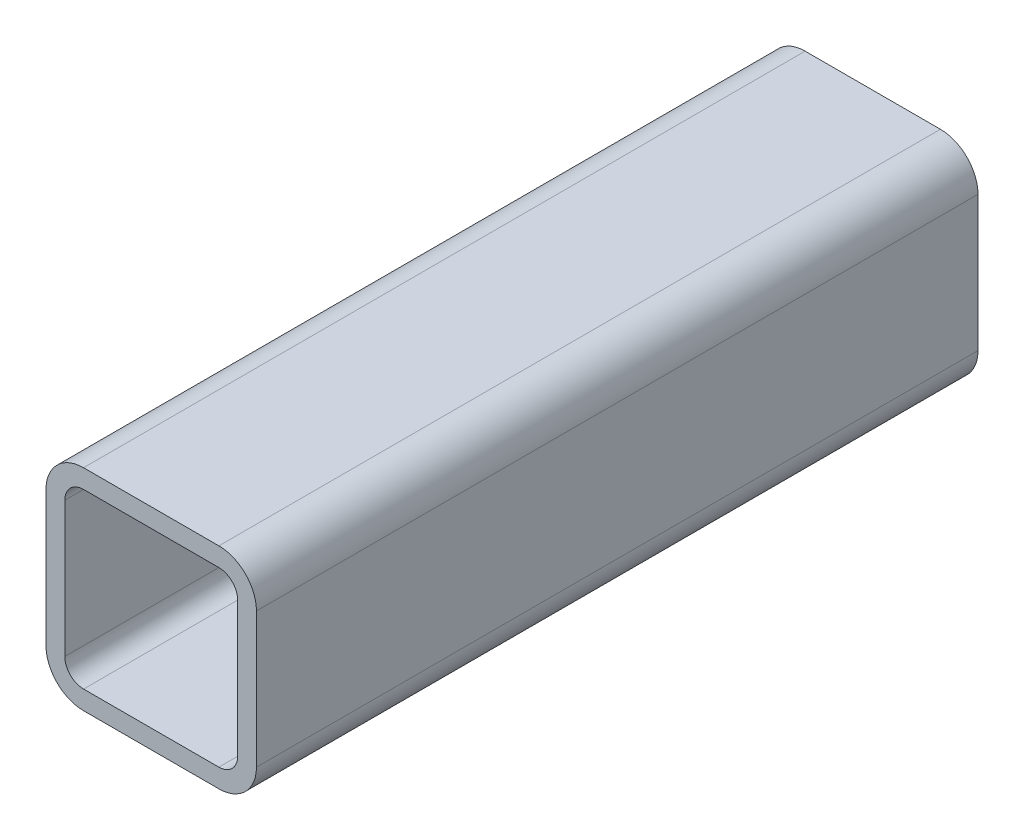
ISO-10303-21;
HEADER;
FILE_DESCRIPTION(('STEP AP214'),'2;1');
FILE_NAME('part.step','',(''),(''),'','','');
FILE_SCHEMA(('AUTOMOTIVE_DESIGN { 1 0 10303 214 1 1 1 1 }'));
ENDSEC;
DATA;
#1=APPLICATION_CONTEXT('core data for automotive mechanical design processes');
#2=APPLICATION_PROTOCOL_DEFINITION('international standard','automotive_design',2000,#1);
#3=PRODUCT_CONTEXT('',#1,'mechanical');
#4=PRODUCT('Part','Part','',(#3));
#5=PRODUCT_RELATED_PRODUCT_CATEGORY('part','',(#4));
#6=PRODUCT_DEFINITION_FORMATION('','',#4);
#7=PRODUCT_DEFINITION_CONTEXT('part definition',#1,'design');
#8=PRODUCT_DEFINITION('design','',#6,#7);
#9=PRODUCT_DEFINITION_SHAPE('','',#8);
#10=(LENGTH_UNIT() NAMED_UNIT(*) SI_UNIT(.MILLI.,.METRE.));
#11=(NAMED_UNIT(*) PLANE_ANGLE_UNIT() SI_UNIT($,.RADIAN.));
#12=(NAMED_UNIT(*) SI_UNIT($,.STERADIAN.) SOLID_ANGLE_UNIT());
#13=UNCERTAINTY_MEASURE_WITH_UNIT(LENGTH_MEASURE(1.E-05),#10,'distance_accuracy_value','');
#14=(GEOMETRIC_REPRESENTATION_CONTEXT(3) GLOBAL_UNCERTAINTY_ASSIGNED_CONTEXT((#13)) GLOBAL_UNIT_ASSIGNED_CONTEXT((#10,
#11,#12)) REPRESENTATION_CONTEXT('',''));
#15=CARTESIAN_POINT('',(0.,0.,0.));
#16=DIRECTION('',(0.,0.,1.));
#17=DIRECTION('',(1.,0.,0.));
#18=AXIS2_PLACEMENT_3D('',#15,#16,#17);
#19=CARTESIAN_POINT('',(17.9571469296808,73.8265103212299,304.8));
#20=DIRECTION('',(0.,0.,1.));
#21=DIRECTION('',(1.,0.,0.));
#22=AXIS2_PLACEMENT_3D('',#19,#20,#21);
#23=PLANE('',#22);
#24=CARTESIAN_POINT('',(17.9571469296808,73.8265103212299,304.8));
#25=DIRECTION('',(0.,0.,1.));
#26=DIRECTION('',(1.,0.,0.));
#27=AXIS2_PLACEMENT_3D('',#24,#25,#26);
#28=CIRCLE('',#27,15.875);
#29=CARTESIAN_POINT('',(17.9571469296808,89.7015103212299,304.8));
#30=VERTEX_POINT('',#29);
#31=CARTESIAN_POINT('',(2.08214692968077,73.8265103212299,304.8));
#32=VERTEX_POINT('',#31);
#33=EDGE_CURVE('E211',#30,#32,#28,.T.);
#34=ORIENTED_EDGE('',*,*,#33,.T.);
#35=DIRECTION('',(0.,-1.,0.));
#36=VECTOR('',#35,1.);
#37=CARTESIAN_POINT('',(2.08214692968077,16.6765103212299,304.8));
#38=LINE('',#37,#36);
#39=CARTESIAN_POINT('',(2.08214692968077,16.6765103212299,304.8));
#40=VERTEX_POINT('',#39);
#41=EDGE_CURVE('E214',#32,#40,#38,.T.);
#42=ORIENTED_EDGE('',*,*,#41,.T.);
#43=CARTESIAN_POINT('',(17.9571469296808,16.6765103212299,304.8));
#44=DIRECTION('',(0.,0.,1.));
#45=DIRECTION('',(1.,0.,0.));
#46=AXIS2_PLACEMENT_3D('',#43,#44,#45);
#47=CIRCLE('',#46,15.875);
#48=CARTESIAN_POINT('',(17.9571469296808,0.801510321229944,304.8));
#49=VERTEX_POINT('',#48);
#50=EDGE_CURVE('E217',#40,#49,#47,.T.);
#51=ORIENTED_EDGE('',*,*,#50,.T.);
#52=DIRECTION('',(1.,0.,0.));
#53=VECTOR('',#52,1.);
#54=CARTESIAN_POINT('',(75.1071469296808,0.801510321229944,304.8));
#55=LINE('',#54,#53);
#56=CARTESIAN_POINT('',(75.1071469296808,0.801510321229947,304.8));
#57=VERTEX_POINT('',#56);
#58=EDGE_CURVE('E219',#49,#57,#55,.T.);
#59=ORIENTED_EDGE('',*,*,#58,.T.);
#60=CARTESIAN_POINT('',(75.1071469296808,16.6765103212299,304.8));
#61=DIRECTION('',(0.,0.,1.));
#62=DIRECTION('',(1.,0.,0.));
#63=AXIS2_PLACEMENT_3D('',#60,#61,#62);
#64=CIRCLE('',#63,15.875);
#65=CARTESIAN_POINT('',(90.9821469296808,16.6765103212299,304.8));
#66=VERTEX_POINT('',#65);
#67=EDGE_CURVE('E221',#57,#66,#64,.T.);
#68=ORIENTED_EDGE('',*,*,#67,.T.);
#69=DIRECTION('',(0.,1.,0.));
#70=VECTOR('',#69,1.);
#71=CARTESIAN_POINT('',(90.9821469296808,73.8265103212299,304.8));
#72=LINE('',#71,#70);
#73=CARTESIAN_POINT('',(90.9821469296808,73.8265103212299,304.8));
#74=VERTEX_POINT('',#73);
#75=EDGE_CURVE('E223',#66,#74,#72,.T.);
#76=ORIENTED_EDGE('',*,*,#75,.T.);
#77=CARTESIAN_POINT('',(75.1071469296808,73.8265103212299,304.8));
#78=DIRECTION('',(0.,0.,1.));
#79=DIRECTION('',(1.,0.,0.));
#80=AXIS2_PLACEMENT_3D('',#77,#78,#79);
#81=CIRCLE('',#80,15.875);
#82=CARTESIAN_POINT('',(75.1071469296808,89.7015103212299,304.8));
#83=VERTEX_POINT('',#82);
#84=EDGE_CURVE('E225',#74,#83,#81,.T.);
#85=ORIENTED_EDGE('',*,*,#84,.T.);
#86=DIRECTION('',(-1.,0.,0.));
#87=VECTOR('',#86,1.);
#88=CARTESIAN_POINT('',(17.9571469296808,89.7015103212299,304.8));
#89=LINE('',#88,#87);
#90=EDGE_CURVE('E227',#83,#30,#89,.T.);
#91=ORIENTED_EDGE('',*,*,#90,.T.);
#92=EDGE_LOOP('',(#34,#42,#51,#59,#68,#76,#85,#91));
#93=FACE_BOUND('',#92,.T.);
#94=DIRECTION('',(0.,-1.,0.));
#95=VECTOR('',#94,1.);
#96=CARTESIAN_POINT('',(10.0196469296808,16.6765103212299,304.8));
#97=LINE('',#96,#95);
#98=CARTESIAN_POINT('',(10.0196469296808,73.8265103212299,304.8));
#99=VERTEX_POINT('',#98);
#100=CARTESIAN_POINT('',(10.0196469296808,16.6765103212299,304.8));
#101=VERTEX_POINT('',#100);
#102=EDGE_CURVE('E154',#99,#101,#97,.T.);
#103=ORIENTED_EDGE('',*,*,#102,.F.);
#104=CARTESIAN_POINT('',(17.9571469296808,73.8265103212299,304.8));
#105=DIRECTION('',(0.,0.,1.));
#106=DIRECTION('',(1.,0.,0.));
#107=AXIS2_PLACEMENT_3D('',#104,#105,#106);
#108=CIRCLE('',#107,7.9375);
#109=CARTESIAN_POINT('',(17.9571469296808,81.7640103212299,304.8));
#110=VERTEX_POINT('',#109);
#111=EDGE_CURVE('E146',#110,#99,#108,.T.);
#112=ORIENTED_EDGE('',*,*,#111,.F.);
#113=DIRECTION('',(-1.,0.,0.));
#114=VECTOR('',#113,1.);
#115=CARTESIAN_POINT('',(17.9571469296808,81.7640103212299,304.8));
#116=LINE('',#115,#114);
#117=CARTESIAN_POINT('',(75.1071469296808,81.7640103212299,304.8));
#118=VERTEX_POINT('',#117);
#119=EDGE_CURVE('E179',#118,#110,#116,.T.);
#120=ORIENTED_EDGE('',*,*,#119,.F.);
#121=CARTESIAN_POINT('',(75.1071469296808,73.8265103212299,304.8));
#122=DIRECTION('',(0.,0.,1.));
#123=DIRECTION('',(1.,0.,0.));
#124=AXIS2_PLACEMENT_3D('',#121,#122,#123);
#125=CIRCLE('',#124,7.93749999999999);
#126=CARTESIAN_POINT('',(83.0446469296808,73.8265103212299,304.8));
#127=VERTEX_POINT('',#126);
#128=EDGE_CURVE('E177',#127,#118,#125,.T.);
#129=ORIENTED_EDGE('',*,*,#128,.F.);
#130=DIRECTION('',(0.,1.,0.));
#131=VECTOR('',#130,1.);
#132=CARTESIAN_POINT('',(83.0446469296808,73.8265103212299,304.8));
#133=LINE('',#132,#131);
#134=CARTESIAN_POINT('',(83.0446469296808,16.6765103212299,304.8));
#135=VERTEX_POINT('',#134);
#136=EDGE_CURVE('E175',#135,#127,#133,.T.);
#137=ORIENTED_EDGE('',*,*,#136,.F.);
#138=CARTESIAN_POINT('',(75.1071469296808,16.6765103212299,304.8));
#139=DIRECTION('',(0.,0.,1.));
#140=DIRECTION('',(1.,0.,0.));
#141=AXIS2_PLACEMENT_3D('',#138,#139,#140);
#142=CIRCLE('',#141,7.9375);
#143=CARTESIAN_POINT('',(75.1071469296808,8.73901032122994,304.8));
#144=VERTEX_POINT('',#143);
#145=EDGE_CURVE('E173',#144,#135,#142,.T.);
#146=ORIENTED_EDGE('',*,*,#145,.F.);
#147=DIRECTION('',(1.,0.,0.));
#148=VECTOR('',#147,1.);
#149=CARTESIAN_POINT('',(75.1071469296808,8.73901032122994,304.8));
#150=LINE('',#149,#148);
#151=CARTESIAN_POINT('',(17.9571469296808,8.73901032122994,304.8));
#152=VERTEX_POINT('',#151);
#153=EDGE_CURVE('E169',#152,#144,#150,.T.);
#154=ORIENTED_EDGE('',*,*,#153,.F.);
#155=CARTESIAN_POINT('',(17.9571469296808,16.6765103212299,304.8));
#156=DIRECTION('',(0.,0.,1.));
#157=DIRECTION('',(1.,0.,0.));
#158=AXIS2_PLACEMENT_3D('',#155,#156,#157);
#159=CIRCLE('',#158,7.9375);
#160=EDGE_CURVE('E167',#101,#152,#159,.T.);
#161=ORIENTED_EDGE('',*,*,#160,.F.);
#162=EDGE_LOOP('',(#103,#112,#120,#129,#137,#146,#154,#161));
#163=FACE_BOUND('',#162,.T.);
#164=ADVANCED_FACE('F33',(#93,#163),#23,.T.);
#165=CARTESIAN_POINT('',(17.9571469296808,73.8265103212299,0.));
#166=DIRECTION('',(0.,0.,1.));
#167=DIRECTION('',(1.,0.,0.));
#168=AXIS2_PLACEMENT_3D('',#165,#166,#167);
#169=PLANE('',#168);
#170=CARTESIAN_POINT('',(17.9571469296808,73.8265103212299,0.));
#171=DIRECTION('',(0.,0.,1.));
#172=DIRECTION('',(1.,0.,0.));
#173=AXIS2_PLACEMENT_3D('',#170,#171,#172);
#174=CIRCLE('',#173,15.875);
#175=CARTESIAN_POINT('',(17.9571469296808,89.7015103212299,0.));
#176=VERTEX_POINT('',#175);
#177=CARTESIAN_POINT('',(2.08214692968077,73.8265103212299,0.));
#178=VERTEX_POINT('',#177);
#179=EDGE_CURVE('E162',#176,#178,#174,.T.);
#180=ORIENTED_EDGE('',*,*,#179,.F.);
#181=DIRECTION('',(-1.,0.,0.));
#182=VECTOR('',#181,1.);
#183=CARTESIAN_POINT('',(17.9571469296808,89.7015103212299,0.));
#184=LINE('',#183,#182);
#185=CARTESIAN_POINT('',(75.1071469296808,89.7015103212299,0.));
#186=VERTEX_POINT('',#185);
#187=EDGE_CURVE('E215',#186,#176,#184,.T.);
#188=ORIENTED_EDGE('',*,*,#187,.F.);
#189=CARTESIAN_POINT('',(75.1071469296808,73.8265103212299,0.));
#190=DIRECTION('',(0.,0.,1.));
#191=DIRECTION('',(1.,0.,0.));
#192=AXIS2_PLACEMENT_3D('',#189,#190,#191);
#193=CIRCLE('',#192,15.875);
#194=CARTESIAN_POINT('',(90.9821469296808,73.8265103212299,0.));
#195=VERTEX_POINT('',#194);
#196=EDGE_CURVE('E242',#195,#186,#193,.T.);
#197=ORIENTED_EDGE('',*,*,#196,.F.);
#198=DIRECTION('',(0.,1.,0.));
#199=VECTOR('',#198,1.);
#200=CARTESIAN_POINT('',(90.9821469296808,73.8265103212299,0.));
#201=LINE('',#200,#199);
#202=CARTESIAN_POINT('',(90.9821469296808,16.6765103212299,0.));
#203=VERTEX_POINT('',#202);
#204=EDGE_CURVE('E240',#203,#195,#201,.T.);
#205=ORIENTED_EDGE('',*,*,#204,.F.);
#206=CARTESIAN_POINT('',(75.1071469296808,16.6765103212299,0.));
#207=DIRECTION('',(0.,0.,1.));
#208=DIRECTION('',(1.,0.,0.));
#209=AXIS2_PLACEMENT_3D('',#206,#207,#208);
#210=CIRCLE('',#209,15.875);
#211=CARTESIAN_POINT('',(75.1071469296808,0.801510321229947,0.));
#212=VERTEX_POINT('',#211);
#213=EDGE_CURVE('E238',#212,#203,#210,.T.);
#214=ORIENTED_EDGE('',*,*,#213,.F.);
#215=DIRECTION('',(1.,0.,0.));
#216=VECTOR('',#215,1.);
#217=CARTESIAN_POINT('',(75.1071469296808,0.801510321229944,0.));
#218=LINE('',#217,#216);
#219=CARTESIAN_POINT('',(17.9571469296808,0.801510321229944,0.));
#220=VERTEX_POINT('',#219);
#221=EDGE_CURVE('E236',#220,#212,#218,.T.);
#222=ORIENTED_EDGE('',*,*,#221,.F.);
#223=CARTESIAN_POINT('',(17.9571469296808,16.6765103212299,0.));
#224=DIRECTION('',(0.,0.,1.));
#225=DIRECTION('',(1.,0.,0.));
#226=AXIS2_PLACEMENT_3D('',#223,#224,#225);
#227=CIRCLE('',#226,15.875);
#228=CARTESIAN_POINT('',(2.08214692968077,16.6765103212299,0.));
#229=VERTEX_POINT('',#228);
#230=EDGE_CURVE('E234',#229,#220,#227,.T.);
#231=ORIENTED_EDGE('',*,*,#230,.F.);
#232=DIRECTION('',(0.,-1.,0.));
#233=VECTOR('',#232,1.);
#234=CARTESIAN_POINT('',(2.08214692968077,16.6765103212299,0.));
#235=LINE('',#234,#233);
#236=EDGE_CURVE('E232',#178,#229,#235,.T.);
#237=ORIENTED_EDGE('',*,*,#236,.F.);
#238=EDGE_LOOP('',(#180,#188,#197,#205,#214,#222,#231,#237));
#239=FACE_BOUND('',#238,.T.);
#240=CARTESIAN_POINT('',(17.9571469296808,73.8265103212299,0.));
#241=DIRECTION('',(0.,0.,1.));
#242=DIRECTION('',(1.,0.,0.));
#243=AXIS2_PLACEMENT_3D('',#240,#241,#242);
#244=CIRCLE('',#243,7.9375);
#245=CARTESIAN_POINT('',(17.9571469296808,81.7640103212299,0.));
#246=VERTEX_POINT('',#245);
#247=CARTESIAN_POINT('',(10.0196469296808,73.8265103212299,0.));
#248=VERTEX_POINT('',#247);
#249=EDGE_CURVE('E56',#246,#248,#244,.T.);
#250=ORIENTED_EDGE('',*,*,#249,.T.);
#251=DIRECTION('',(0.,-1.,0.));
#252=VECTOR('',#251,1.);
#253=CARTESIAN_POINT('',(10.0196469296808,16.6765103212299,0.));
#254=LINE('',#253,#252);
#255=CARTESIAN_POINT('',(10.0196469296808,16.6765103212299,0.));
#256=VERTEX_POINT('',#255);
#257=EDGE_CURVE('E161',#248,#256,#254,.T.);
#258=ORIENTED_EDGE('',*,*,#257,.T.);
#259=CARTESIAN_POINT('',(17.9571469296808,16.6765103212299,0.));
#260=DIRECTION('',(0.,0.,1.));
#261=DIRECTION('',(1.,0.,0.));
#262=AXIS2_PLACEMENT_3D('',#259,#260,#261);
#263=CIRCLE('',#262,7.9375);
#264=CARTESIAN_POINT('',(17.9571469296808,8.73901032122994,0.));
#265=VERTEX_POINT('',#264);
#266=EDGE_CURVE('E183',#256,#265,#263,.T.);
#267=ORIENTED_EDGE('',*,*,#266,.T.);
#268=DIRECTION('',(1.,0.,0.));
#269=VECTOR('',#268,1.);
#270=CARTESIAN_POINT('',(75.1071469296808,8.73901032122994,0.));
#271=LINE('',#270,#269);
#272=CARTESIAN_POINT('',(75.1071469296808,8.73901032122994,0.));
#273=VERTEX_POINT('',#272);
#274=EDGE_CURVE('E186',#265,#273,#271,.T.);
#275=ORIENTED_EDGE('',*,*,#274,.T.);
#276=CARTESIAN_POINT('',(75.1071469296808,16.6765103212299,0.));
#277=DIRECTION('',(0.,0.,1.));
#278=DIRECTION('',(1.,0.,0.));
#279=AXIS2_PLACEMENT_3D('',#276,#277,#278);
#280=CIRCLE('',#279,7.9375);
#281=CARTESIAN_POINT('',(83.0446469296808,16.6765103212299,0.));
#282=VERTEX_POINT('',#281);
#283=EDGE_CURVE('E189',#273,#282,#280,.T.);
#284=ORIENTED_EDGE('',*,*,#283,.T.);
#285=DIRECTION('',(0.,1.,0.));
#286=VECTOR('',#285,1.);
#287=CARTESIAN_POINT('',(83.0446469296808,73.8265103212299,0.));
#288=LINE('',#287,#286);
#289=CARTESIAN_POINT('',(83.0446469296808,73.8265103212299,0.));
#290=VERTEX_POINT('',#289);
#291=EDGE_CURVE('E192',#282,#290,#288,.T.);
#292=ORIENTED_EDGE('',*,*,#291,.T.);
#293=CARTESIAN_POINT('',(75.1071469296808,73.8265103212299,0.));
#294=DIRECTION('',(0.,0.,1.));
#295=DIRECTION('',(1.,0.,0.));
#296=AXIS2_PLACEMENT_3D('',#293,#294,#295);
#297=CIRCLE('',#296,7.93749999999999);
#298=CARTESIAN_POINT('',(75.1071469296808,81.7640103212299,0.));
#299=VERTEX_POINT('',#298);
#300=EDGE_CURVE('E195',#290,#299,#297,.T.);
#301=ORIENTED_EDGE('',*,*,#300,.T.);
#302=DIRECTION('',(-1.,0.,0.));
#303=VECTOR('',#302,1.);
#304=CARTESIAN_POINT('',(17.9571469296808,81.7640103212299,0.));
#305=LINE('',#304,#303);
#306=EDGE_CURVE('E155',#299,#246,#305,.T.);
#307=ORIENTED_EDGE('',*,*,#306,.T.);
#308=EDGE_LOOP('',(#250,#258,#267,#275,#284,#292,#301,#307));
#309=FACE_BOUND('',#308,.T.);
#310=ADVANCED_FACE('F272',(#239,#309),#169,.F.);
#311=CARTESIAN_POINT('',(17.9571469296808,73.8265103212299,304.8));
#312=DIRECTION('',(0.,0.,-1.));
#313=DIRECTION('',(-1.,0.,0.));
#314=AXIS2_PLACEMENT_3D('',#311,#312,#313);
#315=CYLINDRICAL_SURFACE('',#314,15.875);
#316=ORIENTED_EDGE('',*,*,#179,.T.);
#317=DIRECTION('',(0.,0.,-1.));
#318=VECTOR('',#317,1.);
#319=CARTESIAN_POINT('',(2.08214692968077,73.8265103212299,304.8));
#320=LINE('',#319,#318);
#321=EDGE_CURVE('E11',#32,#178,#320,.T.);
#322=ORIENTED_EDGE('',*,*,#321,.F.);
#323=ORIENTED_EDGE('',*,*,#33,.F.);
#324=DIRECTION('',(0.,0.,-1.));
#325=VECTOR('',#324,1.);
#326=CARTESIAN_POINT('',(17.9571469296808,89.7015103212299,304.8));
#327=LINE('',#326,#325);
#328=EDGE_CURVE('E229',#30,#176,#327,.T.);
#329=ORIENTED_EDGE('',*,*,#328,.T.);
#330=EDGE_LOOP('',(#316,#322,#323,#329));
#331=FACE_BOUND('',#330,.T.);
#332=ADVANCED_FACE('F35',(#331),#315,.T.);
#333=CARTESIAN_POINT('',(2.08214692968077,16.6765103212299,304.8));
#334=DIRECTION('',(1.,0.,0.));
#335=DIRECTION('',(0.,0.,-1.));
#336=AXIS2_PLACEMENT_3D('',#333,#334,#335);
#337=PLANE('',#336);
#338=ORIENTED_EDGE('',*,*,#236,.T.);
#339=DIRECTION('',(0.,0.,-1.));
#340=VECTOR('',#339,1.);
#341=CARTESIAN_POINT('',(2.08214692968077,16.6765103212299,304.8));
#342=LINE('',#341,#340);
#343=EDGE_CURVE('E41',#40,#229,#342,.T.);
#344=ORIENTED_EDGE('',*,*,#343,.F.);
#345=ORIENTED_EDGE('',*,*,#41,.F.);
#346=ORIENTED_EDGE('',*,*,#321,.T.);
#347=EDGE_LOOP('',(#338,#344,#345,#346));
#348=FACE_BOUND('',#347,.T.);
#349=ADVANCED_FACE('F289',(#348),#337,.F.);
#350=CARTESIAN_POINT('',(17.9571469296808,16.6765103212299,304.8));
#351=DIRECTION('',(0.,0.,-1.));
#352=DIRECTION('',(-1.,0.,0.));
#353=AXIS2_PLACEMENT_3D('',#350,#351,#352);
#354=CYLINDRICAL_SURFACE('',#353,15.875);
#355=ORIENTED_EDGE('',*,*,#230,.T.);
#356=DIRECTION('',(0.,0.,-1.));
#357=VECTOR('',#356,1.);
#358=CARTESIAN_POINT('',(17.9571469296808,0.801510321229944,304.8));
#359=LINE('',#358,#357);
#360=EDGE_CURVE('E259',#49,#220,#359,.T.);
#361=ORIENTED_EDGE('',*,*,#360,.F.);
#362=ORIENTED_EDGE('',*,*,#50,.F.);
#363=ORIENTED_EDGE('',*,*,#343,.T.);
#364=EDGE_LOOP('',(#355,#361,#362,#363));
#365=FACE_BOUND('',#364,.T.);
#366=ADVANCED_FACE('F266',(#365),#354,.T.);
#367=CARTESIAN_POINT('',(75.1071469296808,0.801510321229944,304.8));
#368=DIRECTION('',(0.,1.,0.));
#369=DIRECTION('',(0.,0.,1.));
#370=AXIS2_PLACEMENT_3D('',#367,#368,#369);
#371=PLANE('',#370);
#372=ORIENTED_EDGE('',*,*,#221,.T.);
#373=DIRECTION('',(0.,0.,-1.));
#374=VECTOR('',#373,1.);
#375=CARTESIAN_POINT('',(75.1071469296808,0.801510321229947,304.8));
#376=LINE('',#375,#374);
#377=EDGE_CURVE('E256',#57,#212,#376,.T.);
#378=ORIENTED_EDGE('',*,*,#377,.F.);
#379=ORIENTED_EDGE('',*,*,#58,.F.);
#380=ORIENTED_EDGE('',*,*,#360,.T.);
#381=EDGE_LOOP('',(#372,#378,#379,#380));
#382=FACE_BOUND('',#381,.T.);
#383=ADVANCED_FACE('F278',(#382),#371,.F.);
#384=CARTESIAN_POINT('',(75.1071469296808,16.6765103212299,304.8));
#385=DIRECTION('',(0.,0.,-1.));
#386=DIRECTION('',(-1.,0.,0.));
#387=AXIS2_PLACEMENT_3D('',#384,#385,#386);
#388=CYLINDRICAL_SURFACE('',#387,15.875);
#389=ORIENTED_EDGE('',*,*,#213,.T.);
#390=DIRECTION('',(0.,0.,-1.));
#391=VECTOR('',#390,1.);
#392=CARTESIAN_POINT('',(90.9821469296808,16.6765103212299,304.8));
#393=LINE('',#392,#391);
#394=EDGE_CURVE('E253',#66,#203,#393,.T.);
#395=ORIENTED_EDGE('',*,*,#394,.F.);
#396=ORIENTED_EDGE('',*,*,#67,.F.);
#397=ORIENTED_EDGE('',*,*,#377,.T.);
#398=EDGE_LOOP('',(#389,#395,#396,#397));
#399=FACE_BOUND('',#398,.T.);
#400=ADVANCED_FACE('F282',(#399),#388,.T.);
#401=CARTESIAN_POINT('',(90.9821469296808,73.8265103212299,304.8));
#402=DIRECTION('',(-1.,0.,0.));
#403=DIRECTION('',(0.,0.,1.));
#404=AXIS2_PLACEMENT_3D('',#401,#402,#403);
#405=PLANE('',#404);
#406=ORIENTED_EDGE('',*,*,#204,.T.);
#407=DIRECTION('',(0.,0.,-1.));
#408=VECTOR('',#407,1.);
#409=CARTESIAN_POINT('',(90.9821469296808,73.8265103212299,304.8));
#410=LINE('',#409,#408);
#411=EDGE_CURVE('E250',#74,#195,#410,.T.);
#412=ORIENTED_EDGE('',*,*,#411,.F.);
#413=ORIENTED_EDGE('',*,*,#75,.F.);
#414=ORIENTED_EDGE('',*,*,#394,.T.);
#415=EDGE_LOOP('',(#406,#412,#413,#414));
#416=FACE_BOUND('',#415,.T.);
#417=ADVANCED_FACE('F302',(#416),#405,.F.);
#418=CARTESIAN_POINT('',(75.1071469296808,73.8265103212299,304.8));
#419=DIRECTION('',(0.,0.,-1.));
#420=DIRECTION('',(-1.,0.,0.));
#421=AXIS2_PLACEMENT_3D('',#418,#419,#420);
#422=CYLINDRICAL_SURFACE('',#421,15.875);
#423=ORIENTED_EDGE('',*,*,#196,.T.);
#424=DIRECTION('',(0.,0.,-1.));
#425=VECTOR('',#424,1.);
#426=CARTESIAN_POINT('',(75.1071469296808,89.7015103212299,304.8));
#427=LINE('',#426,#425);
#428=EDGE_CURVE('E247',#83,#186,#427,.T.);
#429=ORIENTED_EDGE('',*,*,#428,.F.);
#430=ORIENTED_EDGE('',*,*,#84,.F.);
#431=ORIENTED_EDGE('',*,*,#411,.T.);
#432=EDGE_LOOP('',(#423,#429,#430,#431));
#433=FACE_BOUND('',#432,.T.);
#434=ADVANCED_FACE('F300',(#433),#422,.T.);
#435=CARTESIAN_POINT('',(17.9571469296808,89.7015103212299,304.8));
#436=DIRECTION('',(0.,-1.,0.));
#437=DIRECTION('',(0.,0.,-1.));
#438=AXIS2_PLACEMENT_3D('',#435,#436,#437);
#439=PLANE('',#438);
#440=ORIENTED_EDGE('',*,*,#187,.T.);
#441=ORIENTED_EDGE('',*,*,#328,.F.);
#442=ORIENTED_EDGE('',*,*,#90,.F.);
#443=ORIENTED_EDGE('',*,*,#428,.T.);
#444=EDGE_LOOP('',(#440,#441,#442,#443));
#445=FACE_BOUND('',#444,.T.);
#446=ADVANCED_FACE('F295',(#445),#439,.F.);
#447=CARTESIAN_POINT('',(17.9571469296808,73.8265103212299,304.8));
#448=DIRECTION('',(0.,0.,-1.));
#449=DIRECTION('',(-1.,0.,0.));
#450=AXIS2_PLACEMENT_3D('',#447,#448,#449);
#451=CYLINDRICAL_SURFACE('',#450,7.9375);
#452=ORIENTED_EDGE('',*,*,#249,.F.);
#453=DIRECTION('',(0.,0.,-1.));
#454=VECTOR('',#453,1.);
#455=CARTESIAN_POINT('',(17.9571469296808,81.7640103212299,304.8));
#456=LINE('',#455,#454);
#457=EDGE_CURVE('E150',#110,#246,#456,.T.);
#458=ORIENTED_EDGE('',*,*,#457,.F.);
#459=ORIENTED_EDGE('',*,*,#111,.T.);
#460=DIRECTION('',(0.,0.,-1.));
#461=VECTOR('',#460,1.);
#462=CARTESIAN_POINT('',(10.0196469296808,73.8265103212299,304.8));
#463=LINE('',#462,#461);
#464=EDGE_CURVE('E149',#99,#248,#463,.T.);
#465=ORIENTED_EDGE('',*,*,#464,.T.);
#466=EDGE_LOOP('',(#452,#458,#459,#465));
#467=FACE_BOUND('',#466,.T.);
#468=ADVANCED_FACE('F148',(#467),#451,.F.);
#469=CARTESIAN_POINT('',(10.0196469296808,16.6765103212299,304.8));
#470=DIRECTION('',(1.,0.,0.));
#471=DIRECTION('',(0.,0.,-1.));
#472=AXIS2_PLACEMENT_3D('',#469,#470,#471);
#473=PLANE('',#472);
#474=ORIENTED_EDGE('',*,*,#257,.F.);
#475=ORIENTED_EDGE('',*,*,#464,.F.);
#476=ORIENTED_EDGE('',*,*,#102,.T.);
#477=DIRECTION('',(0.,0.,-1.));
#478=VECTOR('',#477,1.);
#479=CARTESIAN_POINT('',(10.0196469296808,16.6765103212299,304.8));
#480=LINE('',#479,#478);
#481=EDGE_CURVE('E163',#101,#256,#480,.T.);
#482=ORIENTED_EDGE('',*,*,#481,.T.);
#483=EDGE_LOOP('',(#474,#475,#476,#482));
#484=FACE_BOUND('',#483,.T.);
#485=ADVANCED_FACE('F158',(#484),#473,.T.);
#486=CARTESIAN_POINT('',(17.9571469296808,16.6765103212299,304.8));
#487=DIRECTION('',(0.,0.,-1.));
#488=DIRECTION('',(-1.,0.,0.));
#489=AXIS2_PLACEMENT_3D('',#486,#487,#488);
#490=CYLINDRICAL_SURFACE('',#489,7.9375);
#491=ORIENTED_EDGE('',*,*,#266,.F.);
#492=ORIENTED_EDGE('',*,*,#481,.F.);
#493=ORIENTED_EDGE('',*,*,#160,.T.);
#494=DIRECTION('',(0.,0.,-1.));
#495=VECTOR('',#494,1.);
#496=CARTESIAN_POINT('',(17.9571469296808,8.73901032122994,304.8));
#497=LINE('',#496,#495);
#498=EDGE_CURVE('E208',#152,#265,#497,.T.);
#499=ORIENTED_EDGE('',*,*,#498,.T.);
#500=EDGE_LOOP('',(#491,#492,#493,#499));
#501=FACE_BOUND('',#500,.T.);
#502=ADVANCED_FACE('F327',(#501),#490,.F.);
#503=CARTESIAN_POINT('',(75.1071469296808,8.73901032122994,304.8));
#504=DIRECTION('',(0.,1.,0.));
#505=DIRECTION('',(0.,0.,1.));
#506=AXIS2_PLACEMENT_3D('',#503,#504,#505);
#507=PLANE('',#506);
#508=ORIENTED_EDGE('',*,*,#274,.F.);
#509=ORIENTED_EDGE('',*,*,#498,.F.);
#510=ORIENTED_EDGE('',*,*,#153,.T.);
#511=DIRECTION('',(0.,0.,-1.));
#512=VECTOR('',#511,1.);
#513=CARTESIAN_POINT('',(75.1071469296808,8.73901032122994,304.8));
#514=LINE('',#513,#512);
#515=EDGE_CURVE('E206',#144,#273,#514,.T.);
#516=ORIENTED_EDGE('',*,*,#515,.T.);
#517=EDGE_LOOP('',(#508,#509,#510,#516));
#518=FACE_BOUND('',#517,.T.);
#519=ADVANCED_FACE('F331',(#518),#507,.T.);
#520=CARTESIAN_POINT('',(75.1071469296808,16.6765103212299,304.8));
#521=DIRECTION('',(0.,0.,-1.));
#522=DIRECTION('',(-1.,0.,0.));
#523=AXIS2_PLACEMENT_3D('',#520,#521,#522);
#524=CYLINDRICAL_SURFACE('',#523,7.9375);
#525=ORIENTED_EDGE('',*,*,#283,.F.);
#526=ORIENTED_EDGE('',*,*,#515,.F.);
#527=ORIENTED_EDGE('',*,*,#145,.T.);
#528=DIRECTION('',(0.,0.,-1.));
#529=VECTOR('',#528,1.);
#530=CARTESIAN_POINT('',(83.0446469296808,16.6765103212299,304.8));
#531=LINE('',#530,#529);
#532=EDGE_CURVE('E204',#135,#282,#531,.T.);
#533=ORIENTED_EDGE('',*,*,#532,.T.);
#534=EDGE_LOOP('',(#525,#526,#527,#533));
#535=FACE_BOUND('',#534,.T.);
#536=ADVANCED_FACE('F337',(#535),#524,.F.);
#537=CARTESIAN_POINT('',(83.0446469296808,73.8265103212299,304.8));
#538=DIRECTION('',(-1.,0.,0.));
#539=DIRECTION('',(0.,0.,1.));
#540=AXIS2_PLACEMENT_3D('',#537,#538,#539);
#541=PLANE('',#540);
#542=ORIENTED_EDGE('',*,*,#291,.F.);
#543=ORIENTED_EDGE('',*,*,#532,.F.);
#544=ORIENTED_EDGE('',*,*,#136,.T.);
#545=DIRECTION('',(0.,0.,-1.));
#546=VECTOR('',#545,1.);
#547=CARTESIAN_POINT('',(83.0446469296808,73.8265103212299,304.8));
#548=LINE('',#547,#546);
#549=EDGE_CURVE('E202',#127,#290,#548,.T.);
#550=ORIENTED_EDGE('',*,*,#549,.T.);
#551=EDGE_LOOP('',(#542,#543,#544,#550));
#552=FACE_BOUND('',#551,.T.);
#553=ADVANCED_FACE('F341',(#552),#541,.T.);
#554=CARTESIAN_POINT('',(75.1071469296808,73.8265103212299,304.8));
#555=DIRECTION('',(0.,0.,-1.));
#556=DIRECTION('',(-1.,0.,0.));
#557=AXIS2_PLACEMENT_3D('',#554,#555,#556);
#558=CYLINDRICAL_SURFACE('',#557,7.93749999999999);
#559=ORIENTED_EDGE('',*,*,#300,.F.);
#560=ORIENTED_EDGE('',*,*,#549,.F.);
#561=ORIENTED_EDGE('',*,*,#128,.T.);
#562=DIRECTION('',(0.,0.,-1.));
#563=VECTOR('',#562,1.);
#564=CARTESIAN_POINT('',(75.1071469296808,81.7640103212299,304.8));
#565=LINE('',#564,#563);
#566=EDGE_CURVE('E48',#118,#299,#565,.T.);
#567=ORIENTED_EDGE('',*,*,#566,.T.);
#568=EDGE_LOOP('',(#559,#560,#561,#567));
#569=FACE_BOUND('',#568,.T.);
#570=ADVANCED_FACE('F345',(#569),#558,.F.);
#571=CARTESIAN_POINT('',(17.9571469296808,81.7640103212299,304.8));
#572=DIRECTION('',(0.,-1.,0.));
#573=DIRECTION('',(0.,0.,-1.));
#574=AXIS2_PLACEMENT_3D('',#571,#572,#573);
#575=PLANE('',#574);
#576=ORIENTED_EDGE('',*,*,#306,.F.);
#577=ORIENTED_EDGE('',*,*,#566,.F.);
#578=ORIENTED_EDGE('',*,*,#119,.T.);
#579=ORIENTED_EDGE('',*,*,#457,.T.);
#580=EDGE_LOOP('',(#576,#577,#578,#579));
#581=FACE_BOUND('',#580,.T.);
#582=ADVANCED_FACE('F349',(#581),#575,.T.);
#583=CLOSED_SHELL('',(#164,#310,#332,#349,#366,#383,#400,#417,#434,#446,#468,#485,#502,#519,
#536,#553,#570,#582));
#584=MANIFOLD_SOLID_BREP('B2',#583);
#585=ADVANCED_BREP_SHAPE_REPRESENTATION('',(#18,#584),#14);
#586=SHAPE_DEFINITION_REPRESENTATION(#9,#585);
ENDSEC;
END-ISO-10303-21;
